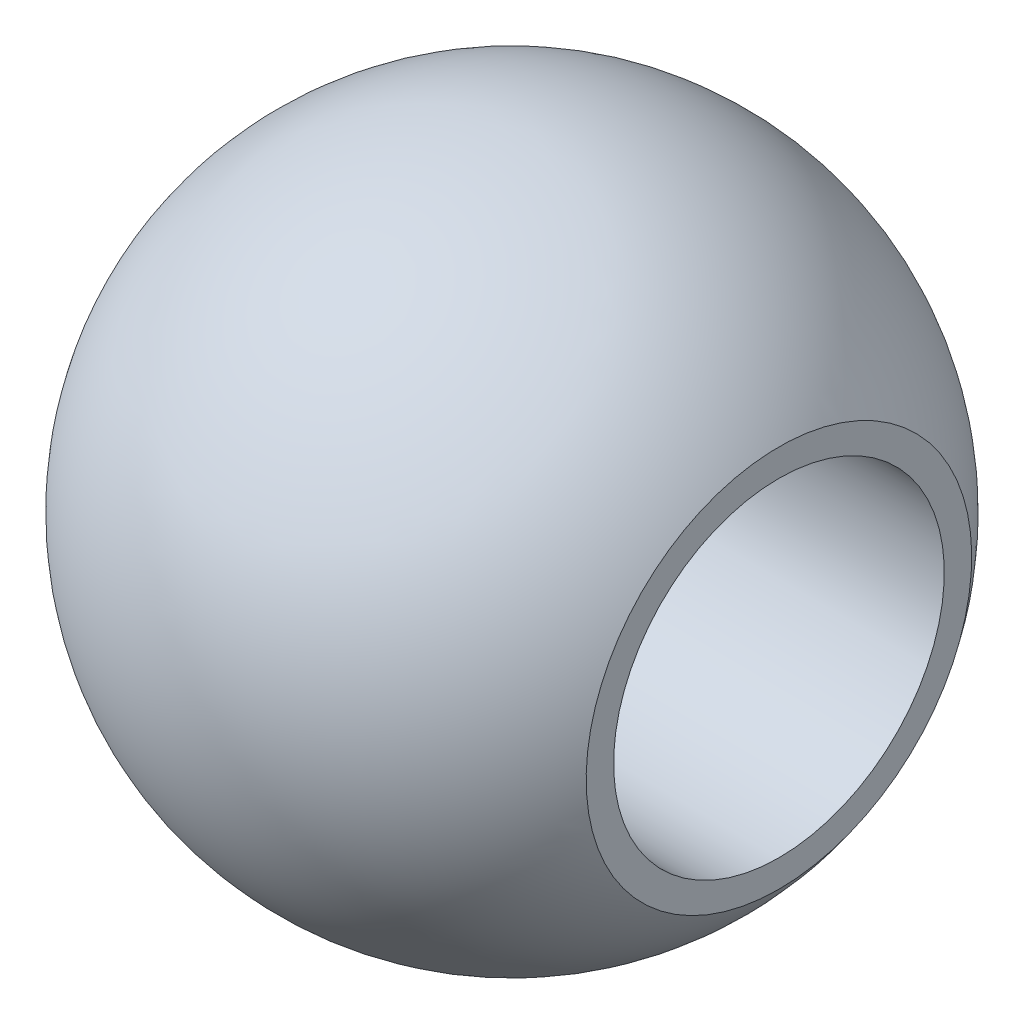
from build123d import *

# Parameters (mm, degrees)
ESQUISSE2_R             = 4
ENL_V_MAT_EXTRU_1_DEPTH = 20.616395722
ESQUISSE3_W             = 30.495954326
ESQUISSE3_H             = 17.702137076
ENL_V_MAT_EXTRU_2_DEPTH = 1.5
ESQUISSE4_W             = 24.717401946
ESQUISSE4_H             = 17.056217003
ENL_V_MAT_EXTRU_3_DEPTH = 5.5


with BuildPart() as part:
    # Esquisse1 → R_volution1 (revolve)
    with BuildSketch(Plane.XY):
        with BuildLine():
            Line((0, 8), (0, -8))
            ThreePointArc((0, -8), (8, 0), (0, 8))
        make_face()
    revolve(axis=Axis((0, -55.215748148, 0), (0, 1, 0)))

    # Esquisse2 → Enl_v. mat.-Extru.1 (cut, through all)
    with BuildSketch(Plane(origin=(7.999921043, -0.0251327, 0.025132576), x_dir=(0.0031415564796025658, -9.869571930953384e-06, -0.9999950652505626), z_dir=(0.9999901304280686, -0.003141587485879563, 0.003141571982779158))):
        with Locations(Location((0, 0, 0), (0, 0, 90))):
            Circle(ESQUISSE2_R)
    extrude(amount=-ENL_V_MAT_EXTRU_1_DEPTH, mode=Mode.SUBTRACT)

    # Esquisse3 → Enl_v. mat.-Extru.2 (cut)
    with BuildSketch(Plane(origin=(7.999921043, -0.0251327, 0.025132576), x_dir=(0.0031415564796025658, -9.869571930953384e-06, -0.9999950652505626), z_dir=(0.9999901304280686, -0.003141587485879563, 0.003141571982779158))):
        with Locations((6.31141809, -1.525889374)):
            Rectangle(ESQUISSE3_W, ESQUISSE3_H)
    extrude(amount=-ENL_V_MAT_EXTRU_2_DEPTH, mode=Mode.SUBTRACT)

    # Esquisse4 → Enl_v. mat.-Extru.3 (cut)
    with BuildSketch(Plane(origin=(-11.999881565, 0.03769905, -0.037698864), x_dir=(0.0031415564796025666, -9.869571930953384e-06, -0.9999950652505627), z_dir=(0.9999901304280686, -0.0031415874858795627, 0.003141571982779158))):
        with Locations((1.952809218, -0.96165982)):
            Rectangle(ESQUISSE4_W, ESQUISSE4_H)
    extrude(amount=ENL_V_MAT_EXTRU_3_DEPTH, mode=Mode.SUBTRACT)


solid = part.part
